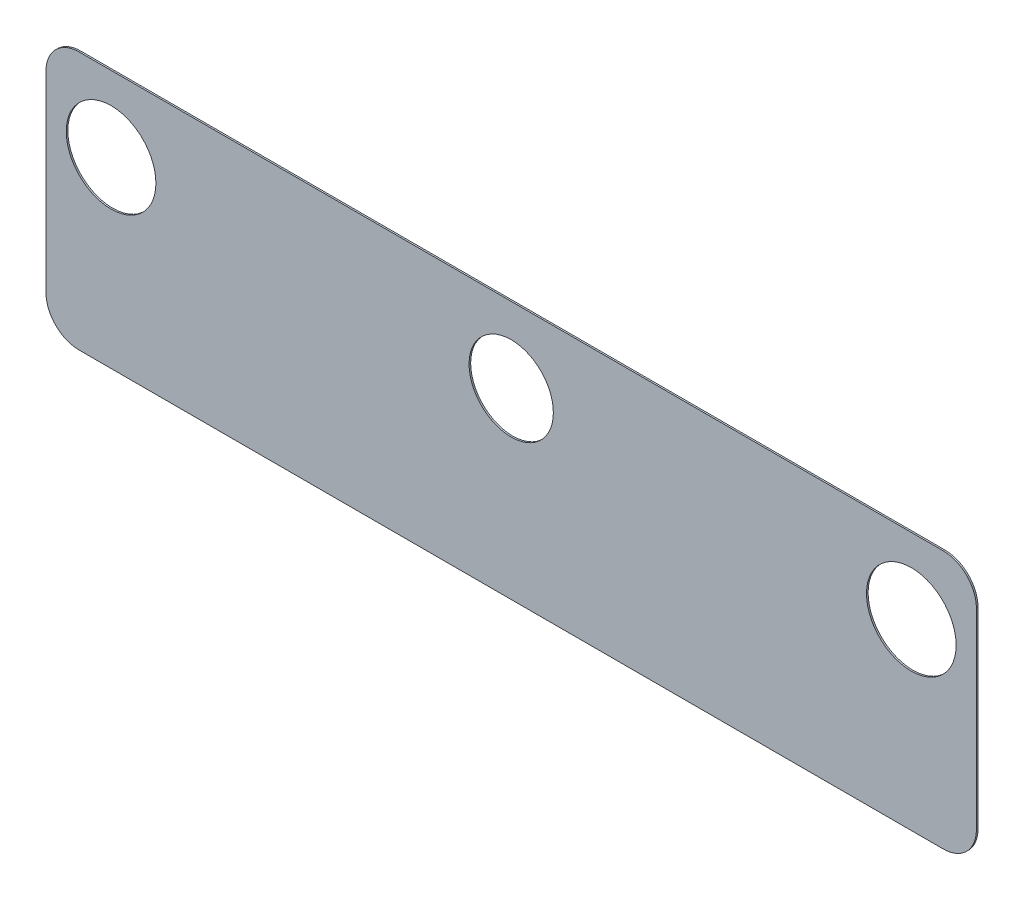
ISO-10303-21;
HEADER;
FILE_DESCRIPTION(('STEP AP214'),'2;1');
FILE_NAME('part.step','',(''),(''),'','','');
FILE_SCHEMA(('AUTOMOTIVE_DESIGN { 1 0 10303 214 1 1 1 1 }'));
ENDSEC;
DATA;
#1=APPLICATION_CONTEXT('core data for automotive mechanical design processes');
#2=APPLICATION_PROTOCOL_DEFINITION('international standard','automotive_design',2000,#1);
#3=PRODUCT_CONTEXT('',#1,'mechanical');
#4=PRODUCT('Part','Part','',(#3));
#5=PRODUCT_RELATED_PRODUCT_CATEGORY('part','',(#4));
#6=PRODUCT_DEFINITION_FORMATION('','',#4);
#7=PRODUCT_DEFINITION_CONTEXT('part definition',#1,'design');
#8=PRODUCT_DEFINITION('design','',#6,#7);
#9=PRODUCT_DEFINITION_SHAPE('','',#8);
#10=(LENGTH_UNIT() NAMED_UNIT(*) SI_UNIT(.MILLI.,.METRE.));
#11=(NAMED_UNIT(*) PLANE_ANGLE_UNIT() SI_UNIT($,.RADIAN.));
#12=(NAMED_UNIT(*) SI_UNIT($,.STERADIAN.) SOLID_ANGLE_UNIT());
#13=UNCERTAINTY_MEASURE_WITH_UNIT(LENGTH_MEASURE(1.E-05),#10,'distance_accuracy_value','');
#14=(GEOMETRIC_REPRESENTATION_CONTEXT(3) GLOBAL_UNCERTAINTY_ASSIGNED_CONTEXT((#13)) GLOBAL_UNIT_ASSIGNED_CONTEXT((#10,
#11,#12)) REPRESENTATION_CONTEXT('',''));
#15=CARTESIAN_POINT('',(0.,0.,0.));
#16=DIRECTION('',(0.,0.,1.));
#17=DIRECTION('',(1.,0.,0.));
#18=AXIS2_PLACEMENT_3D('',#15,#16,#17);
#19=CARTESIAN_POINT('',(-43.6,7.06,0.));
#20=DIRECTION('',(-1.,0.,0.));
#21=DIRECTION('',(0.,0.,1.));
#22=AXIS2_PLACEMENT_3D('',#19,#20,#21);
#23=PLANE('',#22);
#24=DIRECTION('',(0.,-1.,0.));
#25=VECTOR('',#24,1.);
#26=CARTESIAN_POINT('',(-43.6,3.96,0.));
#27=LINE('',#26,#25);
#28=CARTESIAN_POINT('',(-43.6,3.96,0.));
#29=VERTEX_POINT('',#28);
#30=CARTESIAN_POINT('',(-43.6,-14.04,0.));
#31=VERTEX_POINT('',#30);
#32=EDGE_CURVE('E220',#29,#31,#27,.T.);
#33=ORIENTED_EDGE('',*,*,#32,.T.);
#34=DIRECTION('',(0.,0.,-1.));
#35=VECTOR('',#34,1.);
#36=CARTESIAN_POINT('',(-43.6,-14.04,0.15));
#37=LINE('',#36,#35);
#38=CARTESIAN_POINT('',(-43.6,-14.04,0.15));
#39=VERTEX_POINT('',#38);
#40=EDGE_CURVE('E11',#39,#31,#37,.T.);
#41=ORIENTED_EDGE('',*,*,#40,.F.);
#42=DIRECTION('',(0.,-1.,0.));
#43=VECTOR('',#42,1.);
#44=CARTESIAN_POINT('',(-43.6,3.96,0.15));
#45=LINE('',#44,#43);
#46=CARTESIAN_POINT('',(-43.6,3.96,0.15));
#47=VERTEX_POINT('',#46);
#48=EDGE_CURVE('E244',#47,#39,#45,.T.);
#49=ORIENTED_EDGE('',*,*,#48,.F.);
#50=DIRECTION('',(0.,0.,-1.));
#51=VECTOR('',#50,1.);
#52=CARTESIAN_POINT('',(-43.6,3.96,0.15));
#53=LINE('',#52,#51);
#54=EDGE_CURVE('E291',#47,#29,#53,.T.);
#55=ORIENTED_EDGE('',*,*,#54,.T.);
#56=EDGE_LOOP('',(#33,#41,#49,#55));
#57=FACE_BOUND('',#56,.T.);
#58=ADVANCED_FACE('F17',(#57),#23,.T.);
#59=CARTESIAN_POINT('',(-40.5,-14.04,3.89262));
#60=DIRECTION('',(0.,0.,-1.));
#61=DIRECTION('',(0.,-1.,0.));
#62=AXIS2_PLACEMENT_3D('',#59,#60,#61);
#63=CYLINDRICAL_SURFACE('',#62,3.1);
#64=DIRECTION('',(0.,0.,-1.));
#65=VECTOR('',#64,1.);
#66=CARTESIAN_POINT('',(-40.5,-17.14,0.15));
#67=LINE('',#66,#65);
#68=CARTESIAN_POINT('',(-40.5,-17.14,0.15));
#69=VERTEX_POINT('',#68);
#70=CARTESIAN_POINT('',(-40.5,-17.14,0.));
#71=VERTEX_POINT('',#70);
#72=EDGE_CURVE('E26',#69,#71,#67,.T.);
#73=ORIENTED_EDGE('',*,*,#72,.F.);
#74=CARTESIAN_POINT('',(-40.5,-14.04,0.15));
#75=DIRECTION('',(0.,0.,1.));
#76=DIRECTION('',(-1.,0.,0.));
#77=AXIS2_PLACEMENT_3D('',#74,#75,#76);
#78=CIRCLE('',#77,3.1);
#79=EDGE_CURVE('E248',#39,#69,#78,.T.);
#80=ORIENTED_EDGE('',*,*,#79,.F.);
#81=ORIENTED_EDGE('',*,*,#40,.T.);
#82=CARTESIAN_POINT('',(-40.5,-14.04,0.));
#83=DIRECTION('',(0.,0.,-1.));
#84=DIRECTION('',(0.,-1.,0.));
#85=AXIS2_PLACEMENT_3D('',#82,#83,#84);
#86=CIRCLE('',#85,3.1);
#87=EDGE_CURVE('E216',#71,#31,#86,.T.);
#88=ORIENTED_EDGE('',*,*,#87,.F.);
#89=EDGE_LOOP('',(#73,#80,#81,#88));
#90=FACE_BOUND('',#89,.T.);
#91=ADVANCED_FACE('F19',(#90),#63,.T.);
#92=CARTESIAN_POINT('',(-43.6,-17.14,0.));
#93=DIRECTION('',(0.,-1.,0.));
#94=DIRECTION('',(0.,0.,-1.));
#95=AXIS2_PLACEMENT_3D('',#92,#93,#94);
#96=PLANE('',#95);
#97=DIRECTION('',(1.,0.,0.));
#98=VECTOR('',#97,1.);
#99=CARTESIAN_POINT('',(-40.5,-17.14,0.));
#100=LINE('',#99,#98);
#101=CARTESIAN_POINT('',(40.5,-17.14,0.));
#102=VERTEX_POINT('',#101);
#103=EDGE_CURVE('E212',#71,#102,#100,.T.);
#104=ORIENTED_EDGE('',*,*,#103,.T.);
#105=DIRECTION('',(0.,0.,-1.));
#106=VECTOR('',#105,1.);
#107=CARTESIAN_POINT('',(40.5,-17.14,0.15));
#108=LINE('',#107,#106);
#109=CARTESIAN_POINT('',(40.5,-17.14,0.15));
#110=VERTEX_POINT('',#109);
#111=EDGE_CURVE('E306',#110,#102,#108,.T.);
#112=ORIENTED_EDGE('',*,*,#111,.F.);
#113=DIRECTION('',(1.,0.,0.));
#114=VECTOR('',#113,1.);
#115=CARTESIAN_POINT('',(-40.5,-17.14,0.15));
#116=LINE('',#115,#114);
#117=EDGE_CURVE('E252',#69,#110,#116,.T.);
#118=ORIENTED_EDGE('',*,*,#117,.F.);
#119=ORIENTED_EDGE('',*,*,#72,.T.);
#120=EDGE_LOOP('',(#104,#112,#118,#119));
#121=FACE_BOUND('',#120,.T.);
#122=ADVANCED_FACE('F316',(#121),#96,.T.);
#123=CARTESIAN_POINT('',(40.5,-14.04,3.89262));
#124=DIRECTION('',(0.,0.,-1.));
#125=DIRECTION('',(1.,0.,0.));
#126=AXIS2_PLACEMENT_3D('',#123,#124,#125);
#127=CYLINDRICAL_SURFACE('',#126,3.1);
#128=DIRECTION('',(0.,0.,-1.));
#129=VECTOR('',#128,1.);
#130=CARTESIAN_POINT('',(43.6,-14.04,0.15));
#131=LINE('',#130,#129);
#132=CARTESIAN_POINT('',(43.6,-14.04,0.15));
#133=VERTEX_POINT('',#132);
#134=CARTESIAN_POINT('',(43.6,-14.04,0.));
#135=VERTEX_POINT('',#134);
#136=EDGE_CURVE('E304',#133,#135,#131,.T.);
#137=ORIENTED_EDGE('',*,*,#136,.F.);
#138=CARTESIAN_POINT('',(40.5,-14.04,0.15));
#139=DIRECTION('',(0.,0.,1.));
#140=DIRECTION('',(0.,-1.,0.));
#141=AXIS2_PLACEMENT_3D('',#138,#139,#140);
#142=CIRCLE('',#141,3.1);
#143=EDGE_CURVE('E256',#110,#133,#142,.T.);
#144=ORIENTED_EDGE('',*,*,#143,.F.);
#145=ORIENTED_EDGE('',*,*,#111,.T.);
#146=CARTESIAN_POINT('',(40.5,-14.04,0.));
#147=DIRECTION('',(0.,0.,-1.));
#148=DIRECTION('',(1.,0.,0.));
#149=AXIS2_PLACEMENT_3D('',#146,#147,#148);
#150=CIRCLE('',#149,3.1);
#151=EDGE_CURVE('E208',#135,#102,#150,.T.);
#152=ORIENTED_EDGE('',*,*,#151,.F.);
#153=EDGE_LOOP('',(#137,#144,#145,#152));
#154=FACE_BOUND('',#153,.T.);
#155=ADVANCED_FACE('F320',(#154),#127,.T.);
#156=CARTESIAN_POINT('',(43.6,-17.14,0.));
#157=DIRECTION('',(1.,0.,0.));
#158=DIRECTION('',(0.,1.,0.));
#159=AXIS2_PLACEMENT_3D('',#156,#157,#158);
#160=PLANE('',#159);
#161=DIRECTION('',(0.,1.,0.));
#162=VECTOR('',#161,1.);
#163=CARTESIAN_POINT('',(43.6,-14.04,0.));
#164=LINE('',#163,#162);
#165=CARTESIAN_POINT('',(43.6,3.96,0.));
#166=VERTEX_POINT('',#165);
#167=EDGE_CURVE('E174',#135,#166,#164,.T.);
#168=ORIENTED_EDGE('',*,*,#167,.T.);
#169=DIRECTION('',(0.,0.,-1.));
#170=VECTOR('',#169,1.);
#171=CARTESIAN_POINT('',(43.6,3.96,0.15));
#172=LINE('',#171,#170);
#173=CARTESIAN_POINT('',(43.6,3.96,0.15));
#174=VERTEX_POINT('',#173);
#175=EDGE_CURVE('E164',#174,#166,#172,.T.);
#176=ORIENTED_EDGE('',*,*,#175,.F.);
#177=DIRECTION('',(0.,1.,0.));
#178=VECTOR('',#177,1.);
#179=CARTESIAN_POINT('',(43.6,-14.04,0.15));
#180=LINE('',#179,#178);
#181=EDGE_CURVE('E260',#133,#174,#180,.T.);
#182=ORIENTED_EDGE('',*,*,#181,.F.);
#183=ORIENTED_EDGE('',*,*,#136,.T.);
#184=EDGE_LOOP('',(#168,#176,#182,#183));
#185=FACE_BOUND('',#184,.T.);
#186=ADVANCED_FACE('F323',(#185),#160,.T.);
#187=CARTESIAN_POINT('',(40.5,3.96,3.89262));
#188=DIRECTION('',(0.,0.,-1.));
#189=DIRECTION('',(0.,1.,0.));
#190=AXIS2_PLACEMENT_3D('',#187,#188,#189);
#191=CYLINDRICAL_SURFACE('',#190,3.1);
#192=DIRECTION('',(0.,0.,-1.));
#193=VECTOR('',#192,1.);
#194=CARTESIAN_POINT('',(40.5,7.06,0.15));
#195=LINE('',#194,#193);
#196=CARTESIAN_POINT('',(40.5,7.06,0.15));
#197=VERTEX_POINT('',#196);
#198=CARTESIAN_POINT('',(40.5,7.06,0.));
#199=VERTEX_POINT('',#198);
#200=EDGE_CURVE('E153',#197,#199,#195,.T.);
#201=ORIENTED_EDGE('',*,*,#200,.F.);
#202=CARTESIAN_POINT('',(40.5,3.96,0.15));
#203=DIRECTION('',(0.,0.,1.));
#204=DIRECTION('',(1.,0.,0.));
#205=AXIS2_PLACEMENT_3D('',#202,#203,#204);
#206=CIRCLE('',#205,3.1);
#207=EDGE_CURVE('E267',#174,#197,#206,.T.);
#208=ORIENTED_EDGE('',*,*,#207,.F.);
#209=ORIENTED_EDGE('',*,*,#175,.T.);
#210=CARTESIAN_POINT('',(40.5,3.96,0.));
#211=DIRECTION('',(0.,0.,-1.));
#212=DIRECTION('',(0.,1.,0.));
#213=AXIS2_PLACEMENT_3D('',#210,#211,#212);
#214=CIRCLE('',#213,3.1);
#215=EDGE_CURVE('E168',#199,#166,#214,.T.);
#216=ORIENTED_EDGE('',*,*,#215,.F.);
#217=EDGE_LOOP('',(#201,#208,#209,#216));
#218=FACE_BOUND('',#217,.T.);
#219=ADVANCED_FACE('F169',(#218),#191,.T.);
#220=CARTESIAN_POINT('',(43.6,7.06,0.));
#221=DIRECTION('',(0.,1.,0.));
#222=DIRECTION('',(1.,0.,0.));
#223=AXIS2_PLACEMENT_3D('',#220,#221,#222);
#224=PLANE('',#223);
#225=DIRECTION('',(-1.,0.,0.));
#226=VECTOR('',#225,1.);
#227=CARTESIAN_POINT('',(40.5,7.06,0.15));
#228=LINE('',#227,#226);
#229=CARTESIAN_POINT('',(-40.5,7.06,0.15));
#230=VERTEX_POINT('',#229);
#231=EDGE_CURVE('E159',#197,#230,#228,.T.);
#232=ORIENTED_EDGE('',*,*,#231,.F.);
#233=ORIENTED_EDGE('',*,*,#200,.T.);
#234=DIRECTION('',(-1.,0.,0.));
#235=VECTOR('',#234,1.);
#236=CARTESIAN_POINT('',(40.5,7.06,0.));
#237=LINE('',#236,#235);
#238=CARTESIAN_POINT('',(-40.5,7.06,0.));
#239=VERTEX_POINT('',#238);
#240=EDGE_CURVE('E157',#199,#239,#237,.T.);
#241=ORIENTED_EDGE('',*,*,#240,.T.);
#242=DIRECTION('',(0.,0.,-1.));
#243=VECTOR('',#242,1.);
#244=CARTESIAN_POINT('',(-40.5,7.06,0.15));
#245=LINE('',#244,#243);
#246=EDGE_CURVE('E165',#230,#239,#245,.T.);
#247=ORIENTED_EDGE('',*,*,#246,.F.);
#248=EDGE_LOOP('',(#232,#233,#241,#247));
#249=FACE_BOUND('',#248,.T.);
#250=ADVANCED_FACE('F155',(#249),#224,.T.);
#251=CARTESIAN_POINT('',(-40.5,3.96,3.89262));
#252=DIRECTION('',(0.,0.,-1.));
#253=DIRECTION('',(-1.,0.,0.));
#254=AXIS2_PLACEMENT_3D('',#251,#252,#253);
#255=CYLINDRICAL_SURFACE('',#254,3.1);
#256=ORIENTED_EDGE('',*,*,#54,.F.);
#257=CARTESIAN_POINT('',(-40.5,3.96,0.15));
#258=DIRECTION('',(0.,0.,1.));
#259=DIRECTION('',(0.,1.,0.));
#260=AXIS2_PLACEMENT_3D('',#257,#258,#259);
#261=CIRCLE('',#260,3.1);
#262=EDGE_CURVE('E271',#230,#47,#261,.T.);
#263=ORIENTED_EDGE('',*,*,#262,.F.);
#264=ORIENTED_EDGE('',*,*,#246,.T.);
#265=CARTESIAN_POINT('',(-40.5,3.96,0.));
#266=DIRECTION('',(0.,0.,-1.));
#267=DIRECTION('',(-1.,0.,0.));
#268=AXIS2_PLACEMENT_3D('',#265,#266,#267);
#269=CIRCLE('',#268,3.1);
#270=EDGE_CURVE('E180',#29,#239,#269,.T.);
#271=ORIENTED_EDGE('',*,*,#270,.F.);
#272=EDGE_LOOP('',(#256,#263,#264,#271));
#273=FACE_BOUND('',#272,.T.);
#274=ADVANCED_FACE('F330',(#273),#255,.T.);
#275=CARTESIAN_POINT('',(37.5,0.,0.15));
#276=DIRECTION('',(0.,0.,1.));
#277=DIRECTION('',(1.,0.,0.));
#278=AXIS2_PLACEMENT_3D('',#275,#276,#277);
#279=CYLINDRICAL_SURFACE('',#278,4.2);
#280=DIRECTION('',(0.,0.,-1.));
#281=VECTOR('',#280,1.);
#282=CARTESIAN_POINT('',(33.3,0.,0.15));
#283=LINE('',#282,#281);
#284=CARTESIAN_POINT('',(33.3,0.,0.15));
#285=VERTEX_POINT('',#284);
#286=CARTESIAN_POINT('',(33.3,0.,0.));
#287=VERTEX_POINT('',#286);
#288=EDGE_CURVE('E48',#285,#287,#283,.T.);
#289=ORIENTED_EDGE('',*,*,#288,.F.);
#290=CARTESIAN_POINT('',(37.5,0.,0.15));
#291=DIRECTION('',(0.,0.,1.));
#292=DIRECTION('',(-1.,0.,0.));
#293=AXIS2_PLACEMENT_3D('',#290,#291,#292);
#294=CIRCLE('',#293,4.2);
#295=CARTESIAN_POINT('',(41.7,0.,0.15));
#296=VERTEX_POINT('',#295);
#297=EDGE_CURVE('E284',#285,#296,#294,.T.);
#298=ORIENTED_EDGE('',*,*,#297,.T.);
#299=DIRECTION('',(0.,0.,-1.));
#300=VECTOR('',#299,1.);
#301=CARTESIAN_POINT('',(41.7,0.,0.15));
#302=LINE('',#301,#300);
#303=CARTESIAN_POINT('',(41.7,0.,0.));
#304=VERTEX_POINT('',#303);
#305=EDGE_CURVE('E38',#296,#304,#302,.T.);
#306=ORIENTED_EDGE('',*,*,#305,.T.);
#307=CARTESIAN_POINT('',(37.5,0.,0.));
#308=DIRECTION('',(0.,0.,1.));
#309=DIRECTION('',(-1.,0.,0.));
#310=AXIS2_PLACEMENT_3D('',#307,#308,#309);
#311=CIRCLE('',#310,4.2);
#312=EDGE_CURVE('E187',#287,#304,#311,.T.);
#313=ORIENTED_EDGE('',*,*,#312,.F.);
#314=EDGE_LOOP('',(#289,#298,#306,#313));
#315=FACE_BOUND('',#314,.T.);
#316=ADVANCED_FACE('F332',(#315),#279,.F.);
#317=CARTESIAN_POINT('',(37.5,0.,0.15));
#318=DIRECTION('',(0.,0.,1.));
#319=DIRECTION('',(1.,0.,0.));
#320=AXIS2_PLACEMENT_3D('',#317,#318,#319);
#321=CYLINDRICAL_SURFACE('',#320,4.2);
#322=ORIENTED_EDGE('',*,*,#305,.F.);
#323=CARTESIAN_POINT('',(37.5,0.,0.15));
#324=DIRECTION('',(0.,0.,1.));
#325=DIRECTION('',(1.,0.,0.));
#326=AXIS2_PLACEMENT_3D('',#323,#324,#325);
#327=CIRCLE('',#326,4.2);
#328=EDGE_CURVE('E287',#296,#285,#327,.T.);
#329=ORIENTED_EDGE('',*,*,#328,.T.);
#330=ORIENTED_EDGE('',*,*,#288,.T.);
#331=CARTESIAN_POINT('',(37.5,0.,0.));
#332=DIRECTION('',(0.,0.,1.));
#333=DIRECTION('',(1.,0.,0.));
#334=AXIS2_PLACEMENT_3D('',#331,#332,#333);
#335=CIRCLE('',#334,4.2);
#336=EDGE_CURVE('E191',#304,#287,#335,.T.);
#337=ORIENTED_EDGE('',*,*,#336,.F.);
#338=EDGE_LOOP('',(#322,#329,#330,#337));
#339=FACE_BOUND('',#338,.T.);
#340=ADVANCED_FACE('F340',(#339),#321,.F.);
#341=CARTESIAN_POINT('',(-37.5,0.,0.15));
#342=DIRECTION('',(0.,0.,1.));
#343=DIRECTION('',(1.,0.,0.));
#344=AXIS2_PLACEMENT_3D('',#341,#342,#343);
#345=CYLINDRICAL_SURFACE('',#344,4.2);
#346=DIRECTION('',(0.,0.,-1.));
#347=VECTOR('',#346,1.);
#348=CARTESIAN_POINT('',(-41.7,0.,0.15));
#349=LINE('',#348,#347);
#350=CARTESIAN_POINT('',(-41.7,0.,0.15));
#351=VERTEX_POINT('',#350);
#352=CARTESIAN_POINT('',(-41.7,0.,0.));
#353=VERTEX_POINT('',#352);
#354=EDGE_CURVE('E263',#351,#353,#349,.T.);
#355=ORIENTED_EDGE('',*,*,#354,.F.);
#356=CARTESIAN_POINT('',(-37.5,0.,0.15));
#357=DIRECTION('',(0.,0.,1.));
#358=DIRECTION('',(-1.,0.,0.));
#359=AXIS2_PLACEMENT_3D('',#356,#357,#358);
#360=CIRCLE('',#359,4.2);
#361=CARTESIAN_POINT('',(-33.3,0.,0.15));
#362=VERTEX_POINT('',#361);
#363=EDGE_CURVE('E276',#351,#362,#360,.T.);
#364=ORIENTED_EDGE('',*,*,#363,.T.);
#365=DIRECTION('',(0.,0.,-1.));
#366=VECTOR('',#365,1.);
#367=CARTESIAN_POINT('',(-33.3,0.,0.15));
#368=LINE('',#367,#366);
#369=CARTESIAN_POINT('',(-33.3,0.,0.));
#370=VERTEX_POINT('',#369);
#371=EDGE_CURVE('E290',#362,#370,#368,.T.);
#372=ORIENTED_EDGE('',*,*,#371,.T.);
#373=CARTESIAN_POINT('',(-37.5,0.,0.));
#374=DIRECTION('',(0.,0.,1.));
#375=DIRECTION('',(-1.,0.,0.));
#376=AXIS2_PLACEMENT_3D('',#373,#374,#375);
#377=CIRCLE('',#376,4.2);
#378=EDGE_CURVE('E202',#353,#370,#377,.T.);
#379=ORIENTED_EDGE('',*,*,#378,.F.);
#380=EDGE_LOOP('',(#355,#364,#372,#379));
#381=FACE_BOUND('',#380,.T.);
#382=ADVANCED_FACE('F363',(#381),#345,.F.);
#383=CARTESIAN_POINT('',(-37.5,0.,0.15));
#384=DIRECTION('',(0.,0.,1.));
#385=DIRECTION('',(1.,0.,0.));
#386=AXIS2_PLACEMENT_3D('',#383,#384,#385);
#387=CYLINDRICAL_SURFACE('',#386,4.2);
#388=ORIENTED_EDGE('',*,*,#371,.F.);
#389=CARTESIAN_POINT('',(-37.5,0.,0.15));
#390=DIRECTION('',(0.,0.,1.));
#391=DIRECTION('',(1.,0.,0.));
#392=AXIS2_PLACEMENT_3D('',#389,#390,#391);
#393=CIRCLE('',#392,4.2);
#394=EDGE_CURVE('E280',#362,#351,#393,.T.);
#395=ORIENTED_EDGE('',*,*,#394,.T.);
#396=ORIENTED_EDGE('',*,*,#354,.T.);
#397=CARTESIAN_POINT('',(-37.5,0.,0.));
#398=DIRECTION('',(0.,0.,1.));
#399=DIRECTION('',(1.,0.,0.));
#400=AXIS2_PLACEMENT_3D('',#397,#398,#399);
#401=CIRCLE('',#400,4.2);
#402=EDGE_CURVE('E192',#370,#353,#401,.T.);
#403=ORIENTED_EDGE('',*,*,#402,.F.);
#404=EDGE_LOOP('',(#388,#395,#396,#403));
#405=FACE_BOUND('',#404,.T.);
#406=ADVANCED_FACE('F362',(#405),#387,.F.);
#407=CARTESIAN_POINT('',(0.,0.,0.15));
#408=DIRECTION('',(0.,0.,1.));
#409=DIRECTION('',(1.,0.,0.));
#410=AXIS2_PLACEMENT_3D('',#407,#408,#409);
#411=PLANE('',#410);
#412=CARTESIAN_POINT('',(0.,0.,0.15));
#413=DIRECTION('',(0.,0.,1.));
#414=DIRECTION('',(-1.,0.,0.));
#415=AXIS2_PLACEMENT_3D('',#412,#413,#414);
#416=CIRCLE('',#415,3.95);
#417=CARTESIAN_POINT('',(-3.95,0.,0.15));
#418=VERTEX_POINT('',#417);
#419=CARTESIAN_POINT('',(3.95,0.,0.15));
#420=VERTEX_POINT('',#419);
#421=EDGE_CURVE('E235',#418,#420,#416,.T.);
#422=ORIENTED_EDGE('',*,*,#421,.F.);
#423=CARTESIAN_POINT('',(0.,0.,0.15));
#424=DIRECTION('',(0.,0.,1.));
#425=DIRECTION('',(1.,0.,0.));
#426=AXIS2_PLACEMENT_3D('',#423,#424,#425);
#427=CIRCLE('',#426,3.95);
#428=EDGE_CURVE('E236',#420,#418,#427,.T.);
#429=ORIENTED_EDGE('',*,*,#428,.F.);
#430=EDGE_LOOP('',(#422,#429));
#431=FACE_BOUND('',#430,.T.);
#432=ORIENTED_EDGE('',*,*,#297,.F.);
#433=ORIENTED_EDGE('',*,*,#328,.F.);
#434=EDGE_LOOP('',(#432,#433));
#435=FACE_BOUND('',#434,.T.);
#436=ORIENTED_EDGE('',*,*,#363,.F.);
#437=ORIENTED_EDGE('',*,*,#394,.F.);
#438=EDGE_LOOP('',(#436,#437));
#439=FACE_BOUND('',#438,.T.);
#440=ORIENTED_EDGE('',*,*,#48,.T.);
#441=ORIENTED_EDGE('',*,*,#79,.T.);
#442=ORIENTED_EDGE('',*,*,#117,.T.);
#443=ORIENTED_EDGE('',*,*,#143,.T.);
#444=ORIENTED_EDGE('',*,*,#181,.T.);
#445=ORIENTED_EDGE('',*,*,#207,.T.);
#446=ORIENTED_EDGE('',*,*,#231,.T.);
#447=ORIENTED_EDGE('',*,*,#262,.T.);
#448=EDGE_LOOP('',(#440,#441,#442,#443,#444,#445,#446,#447));
#449=FACE_BOUND('',#448,.T.);
#450=ADVANCED_FACE('F325',(#431,#435,#439,#449),#411,.T.);
#451=CARTESIAN_POINT('',(0.,0.,0.15));
#452=DIRECTION('',(0.,0.,1.));
#453=DIRECTION('',(1.,0.,0.));
#454=AXIS2_PLACEMENT_3D('',#451,#452,#453);
#455=CYLINDRICAL_SURFACE('',#454,3.95);
#456=DIRECTION('',(0.,0.,-1.));
#457=VECTOR('',#456,1.);
#458=CARTESIAN_POINT('',(-3.95,0.,0.15));
#459=LINE('',#458,#457);
#460=CARTESIAN_POINT('',(-3.95,0.,0.));
#461=VERTEX_POINT('',#460);
#462=EDGE_CURVE('E232',#418,#461,#459,.T.);
#463=ORIENTED_EDGE('',*,*,#462,.F.);
#464=ORIENTED_EDGE('',*,*,#421,.T.);
#465=DIRECTION('',(0.,0.,-1.));
#466=VECTOR('',#465,1.);
#467=CARTESIAN_POINT('',(3.95,0.,0.15));
#468=LINE('',#467,#466);
#469=CARTESIAN_POINT('',(3.95,0.,0.));
#470=VERTEX_POINT('',#469);
#471=EDGE_CURVE('E201',#420,#470,#468,.T.);
#472=ORIENTED_EDGE('',*,*,#471,.T.);
#473=CARTESIAN_POINT('',(0.,0.,0.));
#474=DIRECTION('',(0.,0.,1.));
#475=DIRECTION('',(-1.,0.,0.));
#476=AXIS2_PLACEMENT_3D('',#473,#474,#475);
#477=CIRCLE('',#476,3.95);
#478=EDGE_CURVE('E196',#461,#470,#477,.T.);
#479=ORIENTED_EDGE('',*,*,#478,.F.);
#480=EDGE_LOOP('',(#463,#464,#472,#479));
#481=FACE_BOUND('',#480,.T.);
#482=ADVANCED_FACE('F396',(#481),#455,.F.);
#483=CARTESIAN_POINT('',(0.,0.,0.15));
#484=DIRECTION('',(0.,0.,1.));
#485=DIRECTION('',(1.,0.,0.));
#486=AXIS2_PLACEMENT_3D('',#483,#484,#485);
#487=CYLINDRICAL_SURFACE('',#486,3.95);
#488=ORIENTED_EDGE('',*,*,#471,.F.);
#489=ORIENTED_EDGE('',*,*,#428,.T.);
#490=ORIENTED_EDGE('',*,*,#462,.T.);
#491=CARTESIAN_POINT('',(0.,0.,0.));
#492=DIRECTION('',(0.,0.,1.));
#493=DIRECTION('',(1.,0.,0.));
#494=AXIS2_PLACEMENT_3D('',#491,#492,#493);
#495=CIRCLE('',#494,3.95);
#496=EDGE_CURVE('E197',#470,#461,#495,.T.);
#497=ORIENTED_EDGE('',*,*,#496,.F.);
#498=EDGE_LOOP('',(#488,#489,#490,#497));
#499=FACE_BOUND('',#498,.T.);
#500=ADVANCED_FACE('F405',(#499),#487,.F.);
#501=CARTESIAN_POINT('',(0.,0.,0.));
#502=DIRECTION('',(0.,0.,1.));
#503=DIRECTION('',(1.,0.,0.));
#504=AXIS2_PLACEMENT_3D('',#501,#502,#503);
#505=PLANE('',#504);
#506=ORIENTED_EDGE('',*,*,#478,.T.);
#507=ORIENTED_EDGE('',*,*,#496,.T.);
#508=EDGE_LOOP('',(#506,#507));
#509=FACE_BOUND('',#508,.T.);
#510=ORIENTED_EDGE('',*,*,#312,.T.);
#511=ORIENTED_EDGE('',*,*,#336,.T.);
#512=EDGE_LOOP('',(#510,#511));
#513=FACE_BOUND('',#512,.T.);
#514=ORIENTED_EDGE('',*,*,#378,.T.);
#515=ORIENTED_EDGE('',*,*,#402,.T.);
#516=EDGE_LOOP('',(#514,#515));
#517=FACE_BOUND('',#516,.T.);
#518=ORIENTED_EDGE('',*,*,#240,.F.);
#519=ORIENTED_EDGE('',*,*,#215,.T.);
#520=ORIENTED_EDGE('',*,*,#167,.F.);
#521=ORIENTED_EDGE('',*,*,#151,.T.);
#522=ORIENTED_EDGE('',*,*,#103,.F.);
#523=ORIENTED_EDGE('',*,*,#87,.T.);
#524=ORIENTED_EDGE('',*,*,#32,.F.);
#525=ORIENTED_EDGE('',*,*,#270,.T.);
#526=EDGE_LOOP('',(#518,#519,#520,#521,#522,#523,#524,#525));
#527=FACE_BOUND('',#526,.T.);
#528=ADVANCED_FACE('F177',(#509,#513,#517,#527),#505,.F.);
#529=CLOSED_SHELL('',(#58,#91,#122,#155,#186,#219,#250,#274,#316,#340,#382,#406,#450,#482,#500,#528));
#530=MANIFOLD_SOLID_BREP('B1',#529);
#531=ADVANCED_BREP_SHAPE_REPRESENTATION('',(#18,#530),#14);
#532=SHAPE_DEFINITION_REPRESENTATION(#9,#531);
ENDSEC;
END-ISO-10303-21;
